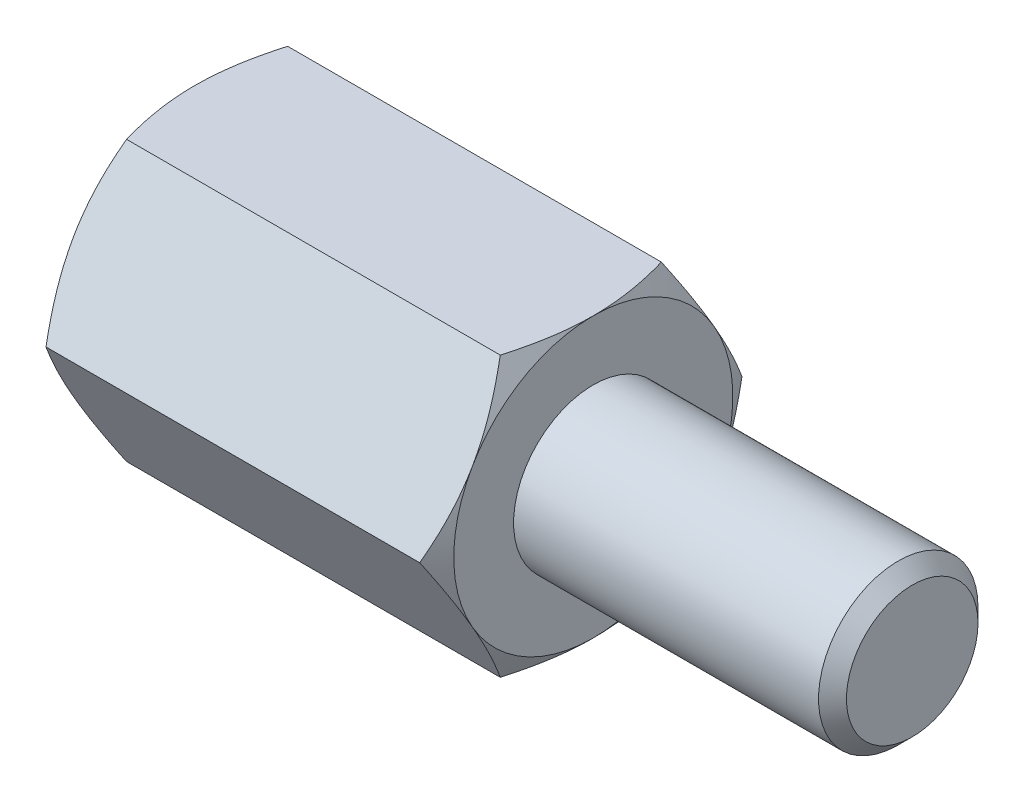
ISO-10303-21;
HEADER;
FILE_DESCRIPTION(('STEP AP214'),'2;1');
FILE_NAME('part.step','',(''),(''),'','','');
FILE_SCHEMA(('AUTOMOTIVE_DESIGN { 1 0 10303 214 1 1 1 1 }'));
ENDSEC;
DATA;
#1=APPLICATION_CONTEXT('core data for automotive mechanical design processes');
#2=APPLICATION_PROTOCOL_DEFINITION('international standard','automotive_design',2000,#1);
#3=PRODUCT_CONTEXT('',#1,'mechanical');
#4=PRODUCT('Part','Part','',(#3));
#5=PRODUCT_RELATED_PRODUCT_CATEGORY('part','',(#4));
#6=PRODUCT_DEFINITION_FORMATION('','',#4);
#7=PRODUCT_DEFINITION_CONTEXT('part definition',#1,'design');
#8=PRODUCT_DEFINITION('design','',#6,#7);
#9=PRODUCT_DEFINITION_SHAPE('','',#8);
#10=(LENGTH_UNIT() NAMED_UNIT(*) SI_UNIT(.MILLI.,.METRE.));
#11=(NAMED_UNIT(*) PLANE_ANGLE_UNIT() SI_UNIT($,.RADIAN.));
#12=(NAMED_UNIT(*) SI_UNIT($,.STERADIAN.) SOLID_ANGLE_UNIT());
#13=UNCERTAINTY_MEASURE_WITH_UNIT(LENGTH_MEASURE(1.E-05),#10,'distance_accuracy_value','');
#14=(GEOMETRIC_REPRESENTATION_CONTEXT(3) GLOBAL_UNCERTAINTY_ASSIGNED_CONTEXT((#13)) GLOBAL_UNIT_ASSIGNED_CONTEXT((#10,
#11,#12)) REPRESENTATION_CONTEXT('',''));
#15=CARTESIAN_POINT('',(0.,0.,0.));
#16=DIRECTION('',(0.,0.,1.));
#17=DIRECTION('',(1.,0.,0.));
#18=AXIS2_PLACEMENT_3D('',#15,#16,#17);
#19=CARTESIAN_POINT('',(5.,3.5,-2.02072594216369));
#20=DIRECTION('',(1.,0.,0.));
#21=DIRECTION('',(0.,0.,-1.));
#22=AXIS2_PLACEMENT_3D('',#19,#20,#21);
#23=PLANE('',#22);
#24=CARTESIAN_POINT('',(5.,0.,0.));
#25=DIRECTION('',(1.,0.,0.));
#26=DIRECTION('',(0.,0.,-1.));
#27=AXIS2_PLACEMENT_3D('',#24,#25,#26);
#28=CIRCLE('',#27,3.5);
#29=CARTESIAN_POINT('',(5.,-1.75,-3.03108891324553));
#30=VERTEX_POINT('',#29);
#31=CARTESIAN_POINT('',(5.,1.75,-3.03108891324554));
#32=VERTEX_POINT('',#31);
#33=EDGE_CURVE('E288',#30,#32,#28,.T.);
#34=ORIENTED_EDGE('',*,*,#33,.T.);
#35=CARTESIAN_POINT('',(5.,3.5,0.));
#36=VERTEX_POINT('',#35);
#37=EDGE_CURVE('E53',#32,#36,#28,.T.);
#38=ORIENTED_EDGE('',*,*,#37,.T.);
#39=CARTESIAN_POINT('',(5.,1.75,3.03108891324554));
#40=VERTEX_POINT('',#39);
#41=EDGE_CURVE('E297',#36,#40,#28,.T.);
#42=ORIENTED_EDGE('',*,*,#41,.T.);
#43=CARTESIAN_POINT('',(5.,-1.75,3.03108891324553));
#44=VERTEX_POINT('',#43);
#45=EDGE_CURVE('E303',#40,#44,#28,.T.);
#46=ORIENTED_EDGE('',*,*,#45,.T.);
#47=CARTESIAN_POINT('',(5.,0.,0.));
#48=DIRECTION('',(-1.,0.,0.));
#49=DIRECTION('',(0.,-1.,0.));
#50=AXIS2_PLACEMENT_3D('',#47,#48,#49);
#51=CIRCLE('',#50,3.5);
#52=CARTESIAN_POINT('',(5.,-3.5,0.));
#53=VERTEX_POINT('',#52);
#54=EDGE_CURVE('E193',#53,#44,#51,.T.);
#55=ORIENTED_EDGE('',*,*,#54,.F.);
#56=EDGE_CURVE('E61',#53,#30,#28,.T.);
#57=ORIENTED_EDGE('',*,*,#56,.T.);
#58=EDGE_LOOP('',(#34,#38,#42,#46,#55,#57));
#59=FACE_BOUND('',#58,.T.);
#60=CARTESIAN_POINT('',(5.,0.,0.));
#61=DIRECTION('',(1.,0.,0.));
#62=DIRECTION('',(0.,0.,-1.));
#63=AXIS2_PLACEMENT_3D('',#60,#61,#62);
#64=CIRCLE('',#63,2.);
#65=CARTESIAN_POINT('',(5.,0.,-2.));
#66=VERTEX_POINT('',#65);
#67=EDGE_CURVE('E433',#66,#66,#64,.T.);
#68=ORIENTED_EDGE('',*,*,#67,.F.);
#69=EDGE_LOOP('',(#68));
#70=FACE_BOUND('',#69,.T.);
#71=ADVANCED_FACE('F37',(#59,#70),#23,.T.);
#72=CARTESIAN_POINT('',(5.,0.,-4.04145188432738));
#73=DIRECTION('',(0.,-0.5,0.866025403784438));
#74=DIRECTION('',(0.,-0.866025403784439,-0.5));
#75=AXIS2_PLACEMENT_3D('',#72,#73,#74);
#76=PLANE('',#75);
#77=CARTESIAN_POINT('',(4.68732593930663,-0.000200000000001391,-4.04156735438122));
#78=CARTESIAN_POINT('',(4.73861421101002,0.153607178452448,-3.9527667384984));
#79=CARTESIAN_POINT('',(4.78525904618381,0.308742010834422,-3.86319960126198));
#80=CARTESIAN_POINT('',(4.86667812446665,0.621698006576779,-3.68251437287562));
#81=CARTESIAN_POINT('',(4.90142356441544,0.779524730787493,-3.59139307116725));
#82=CARTESIAN_POINT('',(4.95550997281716,1.09322221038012,-3.41027974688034));
#83=CARTESIAN_POINT('',(4.97521091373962,1.24904469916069,-3.32031559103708));
#84=CARTESIAN_POINT('',(4.99872986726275,1.56142288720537,-3.13996396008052));
#85=CARTESIAN_POINT('',(5.00256735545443,1.71797745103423,-3.04957714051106));
#86=CARTESIAN_POINT('',(4.99458469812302,2.01050921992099,-2.88068384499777));
#87=CARTESIAN_POINT('',(4.98472456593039,2.1465302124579,-2.80215208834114));
#88=CARTESIAN_POINT('',(4.9534735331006,2.41768602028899,-2.64560020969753));
#89=CARTESIAN_POINT('',(4.9320719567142,2.55281989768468,-2.5675806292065));
#90=CARTESIAN_POINT('',(4.87856959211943,2.82453479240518,-2.41070596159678));
#91=CARTESIAN_POINT('',(4.84624200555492,2.96108141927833,-2.33187072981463));
#92=CARTESIAN_POINT('',(4.77287106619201,3.2321380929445,-2.17537608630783));
#93=CARTESIAN_POINT('',(4.73184495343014,3.36665161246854,-2.09771466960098));
#94=CARTESIAN_POINT('',(4.68732593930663,3.5002,-2.02061047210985));
#95=B_SPLINE_CURVE_WITH_KNOTS('',3,(#77,#78,#79,#80,#81,#82,#83,#84,#85,#86,#87,#88,#89,#90,#91,
#92,#93,#94),.UNSPECIFIED.,.F.,.F.,(4,2,2,2,2,2,2,2,4),(0.,0.554793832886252,1.11092123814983,
1.65328467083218,2.19498204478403,2.6666513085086,3.13875761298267,3.6213361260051,
4.10296698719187),.UNSPECIFIED.);
#96=CARTESIAN_POINT('',(4.68739260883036,0.,-4.04145188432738));
#97=VERTEX_POINT('',#96);
#98=EDGE_CURVE('E317',#97,#32,#95,.T.);
#99=ORIENTED_EDGE('',*,*,#98,.F.);
#100=DIRECTION('',(-1.,0.,0.));
#101=VECTOR('',#100,1.);
#102=CARTESIAN_POINT('',(5.,0.,-4.04145188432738));
#103=LINE('',#102,#101);
#104=CARTESIAN_POINT('',(-4.68739260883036,0.,-4.04145188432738));
#105=VERTEX_POINT('',#104);
#106=EDGE_CURVE('E264',#97,#105,#103,.T.);
#107=ORIENTED_EDGE('',*,*,#106,.T.);
#108=CARTESIAN_POINT('',(-4.68732593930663,3.5002,-2.02061047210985));
#109=CARTESIAN_POINT('',(-4.73861421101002,3.34639282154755,-2.10941108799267));
#110=CARTESIAN_POINT('',(-4.78525904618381,3.19125798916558,-2.19897822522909));
#111=CARTESIAN_POINT('',(-4.86667812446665,2.87830199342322,-2.37966345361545));
#112=CARTESIAN_POINT('',(-4.90142356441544,2.7204752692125,-2.47078475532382));
#113=CARTESIAN_POINT('',(-4.95550997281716,2.40677778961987,-2.65189807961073));
#114=CARTESIAN_POINT('',(-4.97521091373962,2.25095530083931,-2.74186223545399));
#115=CARTESIAN_POINT('',(-4.99872986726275,1.93857711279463,-2.92221386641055));
#116=CARTESIAN_POINT('',(-5.00256735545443,1.78202254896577,-3.01260068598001));
#117=CARTESIAN_POINT('',(-4.99458469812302,1.48949078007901,-3.1814939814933));
#118=CARTESIAN_POINT('',(-4.98472456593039,1.3534697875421,-3.26002573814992));
#119=CARTESIAN_POINT('',(-4.9534735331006,1.08231397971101,-3.41657761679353));
#120=CARTESIAN_POINT('',(-4.9320719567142,0.947180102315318,-3.49459719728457));
#121=CARTESIAN_POINT('',(-4.87856959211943,0.675465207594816,-3.65147186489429));
#122=CARTESIAN_POINT('',(-4.84624200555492,0.538918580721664,-3.73030709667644));
#123=CARTESIAN_POINT('',(-4.77287106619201,0.267861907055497,-3.88680174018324));
#124=CARTESIAN_POINT('',(-4.73184495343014,0.133348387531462,-3.96446315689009));
#125=CARTESIAN_POINT('',(-4.68732593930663,-0.000200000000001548,-4.04156735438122));
#126=B_SPLINE_CURVE_WITH_KNOTS('',3,(#108,#109,#110,#111,#112,#113,#114,#115,#116,#117,#118,
#119,#120,#121,#122,#123,#124,#125),.UNSPECIFIED.,.F.,.F.,(4,2,2,2,2,2,2,2,4),(0.,
0.554793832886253,1.11092123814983,1.65328467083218,2.19498204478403,2.6666513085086,
3.13875761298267,3.6213361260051,4.10296698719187),.UNSPECIFIED.);
#127=CARTESIAN_POINT('',(-5.,1.75,-3.03108891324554));
#128=VERTEX_POINT('',#127);
#129=EDGE_CURVE('E422',#128,#105,#126,.T.);
#130=ORIENTED_EDGE('',*,*,#129,.F.);
#131=CARTESIAN_POINT('',(-4.68739260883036,3.5,-2.02072594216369));
#132=VERTEX_POINT('',#131);
#133=EDGE_CURVE('E366',#132,#128,#126,.T.);
#134=ORIENTED_EDGE('',*,*,#133,.F.);
#135=DIRECTION('',(-1.,0.,0.));
#136=VECTOR('',#135,1.);
#137=CARTESIAN_POINT('',(5.,3.5,-2.02072594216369));
#138=LINE('',#137,#136);
#139=CARTESIAN_POINT('',(4.68739260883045,3.5,-2.02072594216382));
#140=VERTEX_POINT('',#139);
#141=EDGE_CURVE('E279',#140,#132,#138,.T.);
#142=ORIENTED_EDGE('',*,*,#141,.F.);
#143=EDGE_CURVE('E229',#32,#140,#95,.T.);
#144=ORIENTED_EDGE('',*,*,#143,.F.);
#145=EDGE_LOOP('',(#99,#107,#130,#134,#142,#144));
#146=FACE_BOUND('',#145,.T.);
#147=ADVANCED_FACE('F148',(#146),#76,.F.);
#148=CARTESIAN_POINT('',(5.,3.5,-2.02072594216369));
#149=DIRECTION('',(0.,-1.,0.));
#150=DIRECTION('',(0.,0.,-1.));
#151=AXIS2_PLACEMENT_3D('',#148,#149,#150);
#152=PLANE('',#151);
#153=CARTESIAN_POINT('',(3.24432944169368,3.5,-5.52571367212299));
#154=CARTESIAN_POINT('',(3.3192813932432,3.5,-5.37200190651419));
#155=CARTESIAN_POINT('',(3.39354243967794,3.5,-5.21794762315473));
#156=CARTESIAN_POINT('',(3.54029601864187,3.5,-4.90897223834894));
#157=CARTESIAN_POINT('',(3.61278829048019,3.5,-4.75405101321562));
#158=CARTESIAN_POINT('',(3.75596172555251,3.5,-4.44240758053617));
#159=CARTESIAN_POINT('',(3.82663168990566,3.5,-4.28568021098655));
#160=CARTESIAN_POINT('',(3.96520746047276,3.5,-3.97101270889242));
#161=CARTESIAN_POINT('',(4.03311339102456,3.5,-3.81307263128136));
#162=CARTESIAN_POINT('',(4.16771439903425,3.5,-3.49026114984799));
#163=CARTESIAN_POINT('',(4.23428710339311,3.5,-3.32533845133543));
#164=CARTESIAN_POINT('',(4.36262677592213,3.5,-2.99359992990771));
#165=CARTESIAN_POINT('',(4.42439321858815,3.5,-2.82678390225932));
#166=CARTESIAN_POINT('',(4.54157006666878,3.5,-2.49127529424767));
#167=CARTESIAN_POINT('',(4.59699254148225,3.5,-2.32258697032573));
#168=CARTESIAN_POINT('',(4.69976794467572,3.5,-1.98279215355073));
#169=CARTESIAN_POINT('',(4.74712331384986,3.5,-1.81168640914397));
#170=CARTESIAN_POINT('',(4.83129873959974,3.5,-1.46793354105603));
#171=CARTESIAN_POINT('',(4.86817965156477,3.5,-1.2953015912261));
#172=CARTESIAN_POINT('',(4.92939557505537,3.5,-0.947791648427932));
#173=CARTESIAN_POINT('',(4.95373192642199,3.5,-0.772913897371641));
#174=CARTESIAN_POINT('',(4.9876038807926,3.5,-0.424108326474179));
#175=CARTESIAN_POINT('',(4.99733725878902,3.5,-0.250200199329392));
#176=CARTESIAN_POINT('',(5.00170533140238,3.5,0.0978233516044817));
#177=CARTESIAN_POINT('',(4.99633996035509,3.5,0.27193877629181));
#178=CARTESIAN_POINT('',(4.97501181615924,3.5,0.564711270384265));
#179=CARTESIAN_POINT('',(4.96289198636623,3.5,0.683667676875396));
#180=CARTESIAN_POINT('',(4.93230809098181,3.5,0.920767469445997));
#181=CARTESIAN_POINT('',(4.91384324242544,3.5,1.03891075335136));
#182=CARTESIAN_POINT('',(4.84989562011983,3.5,1.39193174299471));
#183=CARTESIAN_POINT('',(4.79586958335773,3.5,1.62528232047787));
#184=CARTESIAN_POINT('',(4.70145152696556,3.5,1.97433825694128));
#185=CARTESIAN_POINT('',(4.66729009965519,3.5,2.09183268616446));
#186=CARTESIAN_POINT('',(4.59523444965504,3.5,2.32568238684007));
#187=CARTESIAN_POINT('',(4.55734019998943,3.5,2.44203765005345));
#188=CARTESIAN_POINT('',(4.47844216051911,3.5,2.67364238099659));
#189=CARTESIAN_POINT('',(4.43743925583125,3.5,2.78889215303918));
#190=CARTESIAN_POINT('',(4.35282457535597,3.5,3.01842460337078));
#191=CARTESIAN_POINT('',(4.3092128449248,3.5,3.13270729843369));
#192=CARTESIAN_POINT('',(4.19582414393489,3.5,3.42150510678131));
#193=CARTESIAN_POINT('',(4.12456360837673,3.5,3.59543696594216));
#194=CARTESIAN_POINT('',(3.97810267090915,3.5,3.94163961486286));
#195=CARTESIAN_POINT('',(3.90290192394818,3.5,4.11391025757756));
#196=CARTESIAN_POINT('',(3.74942525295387,3.5,4.45713072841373));
#197=CARTESIAN_POINT('',(3.67114846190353,3.5,4.62808016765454));
#198=CARTESIAN_POINT('',(3.51218826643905,3.5,4.96885843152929));
#199=CARTESIAN_POINT('',(3.43150479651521,3.5,5.13868722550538));
#200=CARTESIAN_POINT('',(3.18638713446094,3.5,5.64726192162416));
#201=CARTESIAN_POINT('',(3.0190975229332,3.5,5.98463020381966));
#202=CARTESIAN_POINT('',(2.67958549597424,3.5,6.65678495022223));
#203=CARTESIAN_POINT('',(2.5073639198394,3.5,6.99157184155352));
#204=CARTESIAN_POINT('',(2.17608002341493,3.5,7.62749570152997));
#205=CARTESIAN_POINT('',(2.01732992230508,3.5,7.92879562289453));
#206=CARTESIAN_POINT('',(1.69774734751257,3.5,8.53030635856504));
#207=CARTESIAN_POINT('',(1.53691477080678,3.5,8.83051711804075));
#208=CARTESIAN_POINT('',(1.21417926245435,3.5,9.42918006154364));
#209=CARTESIAN_POINT('',(1.0522810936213,3.5,9.72763481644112));
#210=CARTESIAN_POINT('',(0.727273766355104,3.5,10.3238577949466));
#211=CARTESIAN_POINT('',(0.56416469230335,3.5,10.6216260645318));
#212=CARTESIAN_POINT('',(0.400610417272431,3.5,10.9191478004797));
#213=B_SPLINE_CURVE_WITH_KNOTS('',3,(#153,#154,#155,#156,#157,#158,#159,#160,#161,#162,#163,
#164,#165,#166,#167,#168,#169,#170,#171,#172,#173,#174,#175,#176,#177,#178,#179,#180,#181,#182,
#183,#184,#185,#186,#187,#188,#189,#190,#191,#192,#193,#194,#195,#196,#197,#198,#199,#200,#201,
#202,#203,#204,#205,#206,#207,#208,#209,#210,#211,#212),.UNSPECIFIED.,.F.,.F.,(4,2,2,2,2,2,2,2,
2,2,2,2,2,2,2,2,2,2,2,2,2,2,2,2,2,2,2,2,2,4),(0.,0.513041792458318,1.02615874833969,
1.54190801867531,2.05763406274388,2.59113284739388,3.1246898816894,3.65721433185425,
4.18957737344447,4.71878103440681,5.247928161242,5.76984197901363,6.29175806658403,
6.65030258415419,7.0088913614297,7.72642330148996,8.09346920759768,8.46051776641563,
8.8274622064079,9.19440026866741,9.75822236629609,10.3220939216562,10.8861255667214,
11.4501725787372,12.579801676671,13.7092396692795,14.730918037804,15.7526471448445,
16.7712589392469,17.7898004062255),.UNSPECIFIED.);
#214=EDGE_CURVE('E227',#140,#36,#213,.T.);
#215=ORIENTED_EDGE('',*,*,#214,.F.);
#216=ORIENTED_EDGE('',*,*,#141,.T.);
#217=CARTESIAN_POINT('',(-3.24432944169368,3.5,-5.52571367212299));
#218=CARTESIAN_POINT('',(-3.3192813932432,3.5,-5.37200190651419));
#219=CARTESIAN_POINT('',(-3.39354243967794,3.5,-5.21794762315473));
#220=CARTESIAN_POINT('',(-3.54029601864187,3.5,-4.90897223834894));
#221=CARTESIAN_POINT('',(-3.61278829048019,3.5,-4.75405101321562));
#222=CARTESIAN_POINT('',(-3.75596172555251,3.5,-4.44240758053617));
#223=CARTESIAN_POINT('',(-3.82663168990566,3.5,-4.28568021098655));
#224=CARTESIAN_POINT('',(-3.96520746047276,3.5,-3.97101270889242));
#225=CARTESIAN_POINT('',(-4.03311339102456,3.5,-3.81307263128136));
#226=CARTESIAN_POINT('',(-4.16771439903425,3.5,-3.49026114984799));
#227=CARTESIAN_POINT('',(-4.23428710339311,3.5,-3.32533845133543));
#228=CARTESIAN_POINT('',(-4.36262677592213,3.5,-2.99359992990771));
#229=CARTESIAN_POINT('',(-4.42439321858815,3.5,-2.82678390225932));
#230=CARTESIAN_POINT('',(-4.54157006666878,3.5,-2.49127529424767));
#231=CARTESIAN_POINT('',(-4.59699254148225,3.5,-2.32258697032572));
#232=CARTESIAN_POINT('',(-4.69976794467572,3.5,-1.98279215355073));
#233=CARTESIAN_POINT('',(-4.74712331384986,3.5,-1.81168640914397));
#234=CARTESIAN_POINT('',(-4.83129873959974,3.5,-1.46793354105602));
#235=CARTESIAN_POINT('',(-4.86817965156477,3.5,-1.2953015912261));
#236=CARTESIAN_POINT('',(-4.92939557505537,3.5,-0.947791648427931));
#237=CARTESIAN_POINT('',(-4.95373192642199,3.5,-0.77291389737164));
#238=CARTESIAN_POINT('',(-4.9876038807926,3.5,-0.424108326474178));
#239=CARTESIAN_POINT('',(-4.99733725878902,3.5,-0.250200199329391));
#240=CARTESIAN_POINT('',(-5.00170533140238,3.5,0.0978233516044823));
#241=CARTESIAN_POINT('',(-4.99633996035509,3.5,0.27193877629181));
#242=CARTESIAN_POINT('',(-4.97501181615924,3.5,0.564711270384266));
#243=CARTESIAN_POINT('',(-4.96289198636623,3.5,0.683667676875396));
#244=CARTESIAN_POINT('',(-4.93230809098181,3.5,0.920767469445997));
#245=CARTESIAN_POINT('',(-4.91384324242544,3.5,1.03891075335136));
#246=CARTESIAN_POINT('',(-4.84989562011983,3.5,1.39193174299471));
#247=CARTESIAN_POINT('',(-4.79586958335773,3.5,1.62528232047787));
#248=CARTESIAN_POINT('',(-4.70145152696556,3.5,1.97433825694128));
#249=CARTESIAN_POINT('',(-4.66729009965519,3.5,2.09183268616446));
#250=CARTESIAN_POINT('',(-4.59523444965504,3.5,2.32568238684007));
#251=CARTESIAN_POINT('',(-4.55734019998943,3.5,2.44203765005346));
#252=CARTESIAN_POINT('',(-4.47844216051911,3.5,2.67364238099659));
#253=CARTESIAN_POINT('',(-4.43743925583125,3.5,2.78889215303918));
#254=CARTESIAN_POINT('',(-4.35282457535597,3.5,3.01842460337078));
#255=CARTESIAN_POINT('',(-4.30921284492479,3.5,3.13270729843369));
#256=CARTESIAN_POINT('',(-4.19582414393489,3.5,3.42150510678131));
#257=CARTESIAN_POINT('',(-4.12456360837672,3.5,3.59543696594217));
#258=CARTESIAN_POINT('',(-3.97810267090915,3.5,3.94163961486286));
#259=CARTESIAN_POINT('',(-3.90290192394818,3.5,4.11391025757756));
#260=CARTESIAN_POINT('',(-3.74942525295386,3.5,4.45713072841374));
#261=CARTESIAN_POINT('',(-3.67114846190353,3.5,4.62808016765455));
#262=CARTESIAN_POINT('',(-3.51218826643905,3.5,4.9688584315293));
#263=CARTESIAN_POINT('',(-3.43150479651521,3.5,5.13868722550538));
#264=CARTESIAN_POINT('',(-3.18638713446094,3.5,5.64726192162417));
#265=CARTESIAN_POINT('',(-3.0190975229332,3.5,5.98463020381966));
#266=CARTESIAN_POINT('',(-2.67958549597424,3.5,6.65678495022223));
#267=CARTESIAN_POINT('',(-2.5073639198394,3.5,6.99157184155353));
#268=CARTESIAN_POINT('',(-2.17608002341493,3.5,7.62749570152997));
#269=CARTESIAN_POINT('',(-2.01732992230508,3.5,7.92879562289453));
#270=CARTESIAN_POINT('',(-1.69774734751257,3.5,8.53030635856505));
#271=CARTESIAN_POINT('',(-1.53691477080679,3.5,8.83051711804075));
#272=CARTESIAN_POINT('',(-1.21417926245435,3.5,9.42918006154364));
#273=CARTESIAN_POINT('',(-1.0522810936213,3.5,9.72763481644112));
#274=CARTESIAN_POINT('',(-0.727273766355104,3.5,10.3238577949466));
#275=CARTESIAN_POINT('',(-0.564164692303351,3.5,10.6216260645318));
#276=CARTESIAN_POINT('',(-0.400610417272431,3.5,10.9191478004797));
#277=B_SPLINE_CURVE_WITH_KNOTS('',3,(#217,#218,#219,#220,#221,#222,#223,#224,#225,#226,#227,
#228,#229,#230,#231,#232,#233,#234,#235,#236,#237,#238,#239,#240,#241,#242,#243,#244,#245,#246,
#247,#248,#249,#250,#251,#252,#253,#254,#255,#256,#257,#258,#259,#260,#261,#262,#263,#264,#265,
#266,#267,#268,#269,#270,#271,#272,#273,#274,#275,#276),.UNSPECIFIED.,.F.,.F.,(4,2,2,2,2,2,2,2,
2,2,2,2,2,2,2,2,2,2,2,2,2,2,2,2,2,2,2,2,2,4),(0.,0.513041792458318,1.02615874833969,
1.54190801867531,2.05763406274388,2.59113284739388,3.1246898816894,3.65721433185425,
4.18957737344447,4.71878103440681,5.24792816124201,5.76984197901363,6.29175806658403,
6.65030258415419,7.0088913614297,7.72642330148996,8.09346920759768,8.46051776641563,
8.8274622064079,9.19440026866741,9.75822236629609,10.3220939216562,10.8861255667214,
11.4501725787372,12.579801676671,13.7092396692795,14.730918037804,15.7526471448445,
16.7712589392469,17.7898004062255),.UNSPECIFIED.);
#278=CARTESIAN_POINT('',(-5.,3.5,0.));
#279=VERTEX_POINT('',#278);
#280=EDGE_CURVE('E241',#279,#132,#277,.F.);
#281=ORIENTED_EDGE('',*,*,#280,.F.);
#282=CARTESIAN_POINT('',(-4.68739260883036,3.5,2.02072594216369));
#283=VERTEX_POINT('',#282);
#284=EDGE_CURVE('E249',#283,#279,#277,.F.);
#285=ORIENTED_EDGE('',*,*,#284,.F.);
#286=DIRECTION('',(-1.,0.,0.));
#287=VECTOR('',#286,1.);
#288=CARTESIAN_POINT('',(5.,3.5,2.02072594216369));
#289=LINE('',#288,#287);
#290=CARTESIAN_POINT('',(4.68739260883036,3.5,2.02072594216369));
#291=VERTEX_POINT('',#290);
#292=EDGE_CURVE('E276',#291,#283,#289,.T.);
#293=ORIENTED_EDGE('',*,*,#292,.F.);
#294=EDGE_CURVE('E221',#36,#291,#213,.T.);
#295=ORIENTED_EDGE('',*,*,#294,.F.);
#296=EDGE_LOOP('',(#215,#216,#281,#285,#293,#295));
#297=FACE_BOUND('',#296,.T.);
#298=ADVANCED_FACE('F153',(#297),#152,.F.);
#299=CARTESIAN_POINT('',(5.,3.5,2.02072594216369));
#300=DIRECTION('',(0.,-0.5,-0.866025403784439));
#301=DIRECTION('',(0.,0.866025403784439,-0.5));
#302=AXIS2_PLACEMENT_3D('',#299,#300,#301);
#303=PLANE('',#302);
#304=CARTESIAN_POINT('',(4.68732593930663,3.5002,2.02061047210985));
#305=CARTESIAN_POINT('',(4.73861421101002,3.34639282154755,2.10941108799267));
#306=CARTESIAN_POINT('',(4.78525904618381,3.19125798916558,2.19897822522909));
#307=CARTESIAN_POINT('',(4.86667812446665,2.87830199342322,2.37966345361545));
#308=CARTESIAN_POINT('',(4.90142356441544,2.7204752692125,2.47078475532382));
#309=CARTESIAN_POINT('',(4.95550997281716,2.40677778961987,2.65189807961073));
#310=CARTESIAN_POINT('',(4.97521091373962,2.25095530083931,2.74186223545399));
#311=CARTESIAN_POINT('',(4.99872986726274,1.93857711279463,2.92221386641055));
#312=CARTESIAN_POINT('',(5.00256735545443,1.78202254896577,3.01260068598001));
#313=CARTESIAN_POINT('',(4.99458469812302,1.48949078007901,3.1814939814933));
#314=CARTESIAN_POINT('',(4.98472456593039,1.35346978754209,3.26002573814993));
#315=CARTESIAN_POINT('',(4.9534735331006,1.08231397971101,3.41657761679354));
#316=CARTESIAN_POINT('',(4.9320719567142,0.947180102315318,3.49459719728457));
#317=CARTESIAN_POINT('',(4.87856959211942,0.675465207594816,3.65147186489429));
#318=CARTESIAN_POINT('',(4.84624200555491,0.538918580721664,3.73030709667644));
#319=CARTESIAN_POINT('',(4.77287106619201,0.267861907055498,3.88680174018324));
#320=CARTESIAN_POINT('',(4.73184495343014,0.133348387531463,3.96446315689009));
#321=CARTESIAN_POINT('',(4.68732593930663,-0.000200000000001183,4.04156735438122));
#322=B_SPLINE_CURVE_WITH_KNOTS('',3,(#304,#305,#306,#307,#308,#309,#310,#311,#312,#313,#314,
#315,#316,#317,#318,#319,#320,#321),.UNSPECIFIED.,.F.,.F.,(4,2,2,2,2,2,2,2,4),(0.,
0.554793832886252,1.11092123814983,1.65328467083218,2.19498204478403,2.6666513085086,
3.13875761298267,3.62133612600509,4.10296698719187),.UNSPECIFIED.);
#323=EDGE_CURVE('E228',#291,#40,#322,.T.);
#324=ORIENTED_EDGE('',*,*,#323,.F.);
#325=ORIENTED_EDGE('',*,*,#292,.T.);
#326=CARTESIAN_POINT('',(-4.68732593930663,-0.000200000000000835,4.04156735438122));
#327=CARTESIAN_POINT('',(-4.73861421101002,0.153607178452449,3.9527667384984));
#328=CARTESIAN_POINT('',(-4.78525904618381,0.308742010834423,3.86319960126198));
#329=CARTESIAN_POINT('',(-4.86667812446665,0.621698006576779,3.68251437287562));
#330=CARTESIAN_POINT('',(-4.90142356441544,0.779524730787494,3.59139307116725));
#331=CARTESIAN_POINT('',(-4.95550997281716,1.09322221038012,3.41027974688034));
#332=CARTESIAN_POINT('',(-4.97521091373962,1.24904469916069,3.32031559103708));
#333=CARTESIAN_POINT('',(-4.99872986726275,1.56142288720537,3.13996396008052));
#334=CARTESIAN_POINT('',(-5.00256735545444,1.71797745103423,3.04957714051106));
#335=CARTESIAN_POINT('',(-4.99458469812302,2.01050921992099,2.88068384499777));
#336=CARTESIAN_POINT('',(-4.98472456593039,2.1465302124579,2.80215208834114));
#337=CARTESIAN_POINT('',(-4.9534735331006,2.41768602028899,2.64560020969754));
#338=CARTESIAN_POINT('',(-4.9320719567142,2.55281989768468,2.5675806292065));
#339=CARTESIAN_POINT('',(-4.87856959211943,2.82453479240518,2.41070596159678));
#340=CARTESIAN_POINT('',(-4.84624200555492,2.96108141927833,2.33187072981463));
#341=CARTESIAN_POINT('',(-4.77287106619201,3.2321380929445,2.17537608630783));
#342=CARTESIAN_POINT('',(-4.73184495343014,3.36665161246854,2.09771466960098));
#343=CARTESIAN_POINT('',(-4.68732593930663,3.5002,2.02061047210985));
#344=B_SPLINE_CURVE_WITH_KNOTS('',3,(#326,#327,#328,#329,#330,#331,#332,#333,#334,#335,#336,
#337,#338,#339,#340,#341,#342,#343),.UNSPECIFIED.,.F.,.F.,(4,2,2,2,2,2,2,2,4),(0.,
0.554793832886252,1.11092123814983,1.65328467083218,2.19498204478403,2.6666513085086,
3.13875761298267,3.62133612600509,4.10296698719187),.UNSPECIFIED.);
#345=CARTESIAN_POINT('',(-5.,1.75,3.03108891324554));
#346=VERTEX_POINT('',#345);
#347=EDGE_CURVE('E255',#346,#283,#344,.T.);
#348=ORIENTED_EDGE('',*,*,#347,.F.);
#349=CARTESIAN_POINT('',(-4.68739260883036,0.,4.04145188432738));
#350=VERTEX_POINT('',#349);
#351=EDGE_CURVE('E262',#350,#346,#344,.T.);
#352=ORIENTED_EDGE('',*,*,#351,.F.);
#353=DIRECTION('',(-1.,0.,0.));
#354=VECTOR('',#353,1.);
#355=CARTESIAN_POINT('',(5.,0.,4.04145188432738));
#356=LINE('',#355,#354);
#357=CARTESIAN_POINT('',(4.68739260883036,0.,4.04145188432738));
#358=VERTEX_POINT('',#357);
#359=EDGE_CURVE('E273',#358,#350,#356,.T.);
#360=ORIENTED_EDGE('',*,*,#359,.F.);
#361=EDGE_CURVE('E215',#40,#358,#322,.T.);
#362=ORIENTED_EDGE('',*,*,#361,.F.);
#363=EDGE_LOOP('',(#324,#325,#348,#352,#360,#362));
#364=FACE_BOUND('',#363,.T.);
#365=ADVANCED_FACE('F235',(#364),#303,.F.);
#366=CARTESIAN_POINT('',(5.,0.,4.04145188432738));
#367=DIRECTION('',(0.,0.5,-0.866025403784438));
#368=DIRECTION('',(0.,0.866025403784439,0.5));
#369=AXIS2_PLACEMENT_3D('',#366,#367,#368);
#370=PLANE('',#369);
#371=CARTESIAN_POINT('',(4.68732593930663,0.000199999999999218,4.04156735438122));
#372=CARTESIAN_POINT('',(4.73861421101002,-0.15360717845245,3.9527667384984));
#373=CARTESIAN_POINT('',(4.7852590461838,-0.308742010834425,3.86319960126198));
#374=CARTESIAN_POINT('',(4.86667812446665,-0.621698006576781,3.68251437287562));
#375=CARTESIAN_POINT('',(4.90142356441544,-0.779524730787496,3.59139307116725));
#376=CARTESIAN_POINT('',(4.95550997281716,-1.09322221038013,3.41027974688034));
#377=CARTESIAN_POINT('',(4.97521091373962,-1.24904469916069,3.32031559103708));
#378=CARTESIAN_POINT('',(4.99872986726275,-1.56142288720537,3.13996396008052));
#379=CARTESIAN_POINT('',(5.00256735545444,-1.71797745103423,3.04957714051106));
#380=CARTESIAN_POINT('',(4.99458469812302,-2.01050921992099,2.88068384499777));
#381=CARTESIAN_POINT('',(4.98472456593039,-2.1465302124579,2.80215208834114));
#382=CARTESIAN_POINT('',(4.9534735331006,-2.41768602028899,2.64560020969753));
#383=CARTESIAN_POINT('',(4.9320719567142,-2.55281989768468,2.5675806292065));
#384=CARTESIAN_POINT('',(4.87856959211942,-2.82453479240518,2.41070596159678));
#385=CARTESIAN_POINT('',(4.84624200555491,-2.96108141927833,2.33187072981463));
#386=CARTESIAN_POINT('',(4.77287106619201,-3.2321380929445,2.17537608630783));
#387=CARTESIAN_POINT('',(4.73184495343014,-3.36665161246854,2.09771466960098));
#388=CARTESIAN_POINT('',(4.68732593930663,-3.5002,2.02061047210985));
#389=B_SPLINE_CURVE_WITH_KNOTS('',3,(#371,#372,#373,#374,#375,#376,#377,#378,#379,#380,#381,
#382,#383,#384,#385,#386,#387,#388),.UNSPECIFIED.,.F.,.F.,(4,2,2,2,2,2,2,2,4),(0.,
0.554793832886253,1.11092123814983,1.65328467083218,2.19498204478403,2.6666513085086,
3.13875761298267,3.62133612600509,4.10296698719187),.UNSPECIFIED.);
#390=EDGE_CURVE('E313',#358,#44,#389,.T.);
#391=ORIENTED_EDGE('',*,*,#390,.F.);
#392=ORIENTED_EDGE('',*,*,#359,.T.);
#393=CARTESIAN_POINT('',(-4.68732593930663,-3.5002,2.02061047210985));
#394=CARTESIAN_POINT('',(-4.73861421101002,-3.34639282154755,2.10941108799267));
#395=CARTESIAN_POINT('',(-4.7852590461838,-3.19125798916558,2.19897822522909));
#396=CARTESIAN_POINT('',(-4.86667812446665,-2.87830199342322,2.37966345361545));
#397=CARTESIAN_POINT('',(-4.90142356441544,-2.72047526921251,2.47078475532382));
#398=CARTESIAN_POINT('',(-4.95550997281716,-2.40677778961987,2.65189807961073));
#399=CARTESIAN_POINT('',(-4.97521091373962,-2.25095530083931,2.74186223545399));
#400=CARTESIAN_POINT('',(-4.99872986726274,-1.93857711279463,2.92221386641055));
#401=CARTESIAN_POINT('',(-5.00256735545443,-1.78202254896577,3.01260068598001));
#402=CARTESIAN_POINT('',(-4.99458469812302,-1.48949078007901,3.1814939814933));
#403=CARTESIAN_POINT('',(-4.98472456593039,-1.3534697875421,3.26002573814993));
#404=CARTESIAN_POINT('',(-4.9534735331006,-1.08231397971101,3.41657761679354));
#405=CARTESIAN_POINT('',(-4.9320719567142,-0.947180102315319,3.49459719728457));
#406=CARTESIAN_POINT('',(-4.87856959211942,-0.675465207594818,3.65147186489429));
#407=CARTESIAN_POINT('',(-4.84624200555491,-0.538918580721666,3.73030709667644));
#408=CARTESIAN_POINT('',(-4.77287106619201,-0.2678619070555,3.88680174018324));
#409=CARTESIAN_POINT('',(-4.73184495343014,-0.133348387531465,3.96446315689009));
#410=CARTESIAN_POINT('',(-4.68732593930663,0.000199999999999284,4.04156735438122));
#411=B_SPLINE_CURVE_WITH_KNOTS('',3,(#393,#394,#395,#396,#397,#398,#399,#400,#401,#402,#403,
#404,#405,#406,#407,#408,#409,#410),.UNSPECIFIED.,.F.,.F.,(4,2,2,2,2,2,2,2,4),(0.,
0.554793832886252,1.11092123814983,1.65328467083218,2.19498204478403,2.6666513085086,
3.13875761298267,3.62133612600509,4.10296698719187),.UNSPECIFIED.);
#412=CARTESIAN_POINT('',(-5.,-1.75,3.03108891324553));
#413=VERTEX_POINT('',#412);
#414=EDGE_CURVE('E263',#413,#350,#411,.T.);
#415=ORIENTED_EDGE('',*,*,#414,.F.);
#416=CARTESIAN_POINT('',(-4.68739260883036,-3.5,2.02072594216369));
#417=VERTEX_POINT('',#416);
#418=EDGE_CURVE('E250',#417,#413,#411,.T.);
#419=ORIENTED_EDGE('',*,*,#418,.F.);
#420=DIRECTION('',(-1.,0.,0.));
#421=VECTOR('',#420,1.);
#422=CARTESIAN_POINT('',(5.,-3.5,2.02072594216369));
#423=LINE('',#422,#421);
#424=CARTESIAN_POINT('',(4.68739260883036,-3.5,2.02072594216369));
#425=VERTEX_POINT('',#424);
#426=EDGE_CURVE('E270',#425,#417,#423,.T.);
#427=ORIENTED_EDGE('',*,*,#426,.F.);
#428=EDGE_CURVE('E210',#44,#425,#389,.T.);
#429=ORIENTED_EDGE('',*,*,#428,.F.);
#430=EDGE_LOOP('',(#391,#392,#415,#419,#427,#429));
#431=FACE_BOUND('',#430,.T.);
#432=ADVANCED_FACE('F403',(#431),#370,.F.);
#433=CARTESIAN_POINT('',(5.,-3.5,2.02072594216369));
#434=DIRECTION('',(0.,1.,0.));
#435=DIRECTION('',(0.,0.,1.));
#436=AXIS2_PLACEMENT_3D('',#433,#434,#435);
#437=PLANE('',#436);
#438=CARTESIAN_POINT('',(3.24432944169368,-3.5,-5.525713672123));
#439=CARTESIAN_POINT('',(3.3192813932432,-3.5,-5.37200190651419));
#440=CARTESIAN_POINT('',(3.39354243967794,-3.5,-5.21794762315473));
#441=CARTESIAN_POINT('',(3.54029601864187,-3.5,-4.90897223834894));
#442=CARTESIAN_POINT('',(3.61278829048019,-3.5,-4.75405101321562));
#443=CARTESIAN_POINT('',(3.75596172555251,-3.5,-4.44240758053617));
#444=CARTESIAN_POINT('',(3.82663168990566,-3.5,-4.28568021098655));
#445=CARTESIAN_POINT('',(3.96520746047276,-3.5,-3.97101270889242));
#446=CARTESIAN_POINT('',(4.03311339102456,-3.5,-3.81307263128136));
#447=CARTESIAN_POINT('',(4.16771439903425,-3.5,-3.49026114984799));
#448=CARTESIAN_POINT('',(4.2342871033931,-3.5,-3.32533845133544));
#449=CARTESIAN_POINT('',(4.36262677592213,-3.5,-2.99359992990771));
#450=CARTESIAN_POINT('',(4.42439321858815,-3.5,-2.82678390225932));
#451=CARTESIAN_POINT('',(4.54157006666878,-3.5,-2.49127529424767));
#452=CARTESIAN_POINT('',(4.59699254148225,-3.5,-2.32258697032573));
#453=CARTESIAN_POINT('',(4.69976794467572,-3.5,-1.98279215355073));
#454=CARTESIAN_POINT('',(4.74712331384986,-3.5,-1.81168640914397));
#455=CARTESIAN_POINT('',(4.83129873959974,-3.5,-1.46793354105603));
#456=CARTESIAN_POINT('',(4.86817965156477,-3.5,-1.2953015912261));
#457=CARTESIAN_POINT('',(4.92939557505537,-3.5,-0.947791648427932));
#458=CARTESIAN_POINT('',(4.95373192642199,-3.5,-0.772913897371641));
#459=CARTESIAN_POINT('',(4.9876038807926,-3.5,-0.424108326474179));
#460=CARTESIAN_POINT('',(4.99733725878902,-3.5,-0.250200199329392));
#461=CARTESIAN_POINT('',(5.00170533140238,-3.5,0.0978233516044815));
#462=CARTESIAN_POINT('',(4.99633996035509,-3.5,0.271938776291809));
#463=CARTESIAN_POINT('',(4.97501181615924,-3.5,0.564711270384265));
#464=CARTESIAN_POINT('',(4.96289198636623,-3.5,0.683667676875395));
#465=CARTESIAN_POINT('',(4.93230809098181,-3.5,0.920767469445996));
#466=CARTESIAN_POINT('',(4.91384324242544,-3.5,1.03891075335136));
#467=CARTESIAN_POINT('',(4.84989562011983,-3.5,1.39193174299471));
#468=CARTESIAN_POINT('',(4.79586958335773,-3.5,1.62528232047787));
#469=CARTESIAN_POINT('',(4.70145152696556,-3.5,1.97433825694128));
#470=CARTESIAN_POINT('',(4.66729009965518,-3.5,2.09183268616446));
#471=CARTESIAN_POINT('',(4.59523444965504,-3.5,2.32568238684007));
#472=CARTESIAN_POINT('',(4.55734019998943,-3.5,2.44203765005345));
#473=CARTESIAN_POINT('',(4.47844216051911,-3.5,2.67364238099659));
#474=CARTESIAN_POINT('',(4.43743925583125,-3.5,2.78889215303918));
#475=CARTESIAN_POINT('',(4.35282457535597,-3.5,3.01842460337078));
#476=CARTESIAN_POINT('',(4.3092128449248,-3.5,3.13270729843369));
#477=CARTESIAN_POINT('',(4.19582414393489,-3.5,3.42150510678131));
#478=CARTESIAN_POINT('',(4.12456360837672,-3.5,3.59543696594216));
#479=CARTESIAN_POINT('',(3.97810267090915,-3.5,3.94163961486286));
#480=CARTESIAN_POINT('',(3.90290192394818,-3.5,4.11391025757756));
#481=CARTESIAN_POINT('',(3.74942525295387,-3.5,4.45713072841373));
#482=CARTESIAN_POINT('',(3.67114846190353,-3.5,4.62808016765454));
#483=CARTESIAN_POINT('',(3.51218826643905,-3.5,4.96885843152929));
#484=CARTESIAN_POINT('',(3.43150479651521,-3.5,5.13868722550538));
#485=CARTESIAN_POINT('',(3.18638713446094,-3.5,5.64726192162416));
#486=CARTESIAN_POINT('',(3.0190975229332,-3.5,5.98463020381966));
#487=CARTESIAN_POINT('',(2.67958549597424,-3.5,6.65678495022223));
#488=CARTESIAN_POINT('',(2.5073639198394,-3.5,6.99157184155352));
#489=CARTESIAN_POINT('',(2.17608002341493,-3.5,7.62749570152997));
#490=CARTESIAN_POINT('',(2.01732992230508,-3.5,7.92879562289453));
#491=CARTESIAN_POINT('',(1.69774734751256,-3.5,8.53030635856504));
#492=CARTESIAN_POINT('',(1.53691477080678,-3.5,8.83051711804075));
#493=CARTESIAN_POINT('',(1.21417926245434,-3.5,9.42918006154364));
#494=CARTESIAN_POINT('',(1.0522810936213,-3.5,9.72763481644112));
#495=CARTESIAN_POINT('',(0.727273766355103,-3.5,10.3238577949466));
#496=CARTESIAN_POINT('',(0.56416469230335,-3.5,10.6216260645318));
#497=CARTESIAN_POINT('',(0.400610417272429,-3.5,10.9191478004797));
#498=B_SPLINE_CURVE_WITH_KNOTS('',3,(#438,#439,#440,#441,#442,#443,#444,#445,#446,#447,#448,
#449,#450,#451,#452,#453,#454,#455,#456,#457,#458,#459,#460,#461,#462,#463,#464,#465,#466,#467,
#468,#469,#470,#471,#472,#473,#474,#475,#476,#477,#478,#479,#480,#481,#482,#483,#484,#485,#486,
#487,#488,#489,#490,#491,#492,#493,#494,#495,#496,#497),.UNSPECIFIED.,.F.,.F.,(4,2,2,2,2,2,2,2,
2,2,2,2,2,2,2,2,2,2,2,2,2,2,2,2,2,2,2,2,2,4),(0.,0.513041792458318,1.02615874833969,
1.54190801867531,2.05763406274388,2.59113284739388,3.1246898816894,3.65721433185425,
4.18957737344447,4.71878103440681,5.24792816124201,5.76984197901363,6.29175806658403,
6.65030258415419,7.0088913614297,7.72642330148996,8.09346920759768,8.46051776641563,
8.8274622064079,9.19440026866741,9.75822236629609,10.3220939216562,10.8861255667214,
11.4501725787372,12.579801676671,13.7092396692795,14.730918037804,15.7526471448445,
16.7712589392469,17.7898004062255),.UNSPECIFIED.);
#499=EDGE_CURVE('E344',#425,#53,#498,.F.);
#500=ORIENTED_EDGE('',*,*,#499,.F.);
#501=ORIENTED_EDGE('',*,*,#426,.T.);
#502=CARTESIAN_POINT('',(-3.24432944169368,-3.5,-5.525713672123));
#503=CARTESIAN_POINT('',(-3.3192813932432,-3.5,-5.37200190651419));
#504=CARTESIAN_POINT('',(-3.39354243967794,-3.5,-5.21794762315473));
#505=CARTESIAN_POINT('',(-3.54029601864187,-3.5,-4.90897223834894));
#506=CARTESIAN_POINT('',(-3.61278829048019,-3.5,-4.75405101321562));
#507=CARTESIAN_POINT('',(-3.75596172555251,-3.5,-4.44240758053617));
#508=CARTESIAN_POINT('',(-3.82663168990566,-3.5,-4.28568021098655));
#509=CARTESIAN_POINT('',(-3.96520746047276,-3.5,-3.97101270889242));
#510=CARTESIAN_POINT('',(-4.03311339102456,-3.5,-3.81307263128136));
#511=CARTESIAN_POINT('',(-4.16771439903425,-3.5,-3.49026114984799));
#512=CARTESIAN_POINT('',(-4.2342871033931,-3.5,-3.32533845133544));
#513=CARTESIAN_POINT('',(-4.36262677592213,-3.5,-2.99359992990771));
#514=CARTESIAN_POINT('',(-4.42439321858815,-3.5,-2.82678390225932));
#515=CARTESIAN_POINT('',(-4.54157006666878,-3.5,-2.49127529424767));
#516=CARTESIAN_POINT('',(-4.59699254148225,-3.5,-2.32258697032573));
#517=CARTESIAN_POINT('',(-4.69976794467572,-3.5,-1.98279215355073));
#518=CARTESIAN_POINT('',(-4.74712331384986,-3.5,-1.81168640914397));
#519=CARTESIAN_POINT('',(-4.83129873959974,-3.5,-1.46793354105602));
#520=CARTESIAN_POINT('',(-4.86817965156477,-3.5,-1.2953015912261));
#521=CARTESIAN_POINT('',(-4.92939557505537,-3.5,-0.947791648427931));
#522=CARTESIAN_POINT('',(-4.95373192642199,-3.5,-0.77291389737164));
#523=CARTESIAN_POINT('',(-4.9876038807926,-3.5,-0.424108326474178));
#524=CARTESIAN_POINT('',(-4.99733725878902,-3.5,-0.250200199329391));
#525=CARTESIAN_POINT('',(-5.00170533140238,-3.5,0.0978233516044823));
#526=CARTESIAN_POINT('',(-4.99633996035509,-3.5,0.27193877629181));
#527=CARTESIAN_POINT('',(-4.97501181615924,-3.5,0.564711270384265));
#528=CARTESIAN_POINT('',(-4.96289198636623,-3.5,0.683667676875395));
#529=CARTESIAN_POINT('',(-4.93230809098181,-3.5,0.920767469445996));
#530=CARTESIAN_POINT('',(-4.91384324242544,-3.5,1.03891075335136));
#531=CARTESIAN_POINT('',(-4.84989562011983,-3.5,1.39193174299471));
#532=CARTESIAN_POINT('',(-4.79586958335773,-3.5,1.62528232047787));
#533=CARTESIAN_POINT('',(-4.70145152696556,-3.5,1.97433825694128));
#534=CARTESIAN_POINT('',(-4.66729009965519,-3.5,2.09183268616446));
#535=CARTESIAN_POINT('',(-4.59523444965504,-3.5,2.32568238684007));
#536=CARTESIAN_POINT('',(-4.55734019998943,-3.5,2.44203765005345));
#537=CARTESIAN_POINT('',(-4.47844216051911,-3.5,2.67364238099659));
#538=CARTESIAN_POINT('',(-4.43743925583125,-3.5,2.78889215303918));
#539=CARTESIAN_POINT('',(-4.35282457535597,-3.5,3.01842460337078));
#540=CARTESIAN_POINT('',(-4.30921284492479,-3.5,3.13270729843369));
#541=CARTESIAN_POINT('',(-4.19582414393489,-3.5,3.42150510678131));
#542=CARTESIAN_POINT('',(-4.12456360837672,-3.5,3.59543696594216));
#543=CARTESIAN_POINT('',(-3.97810267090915,-3.5,3.94163961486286));
#544=CARTESIAN_POINT('',(-3.90290192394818,-3.5,4.11391025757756));
#545=CARTESIAN_POINT('',(-3.74942525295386,-3.5,4.45713072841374));
#546=CARTESIAN_POINT('',(-3.67114846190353,-3.5,4.62808016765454));
#547=CARTESIAN_POINT('',(-3.51218826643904,-3.5,4.96885843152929));
#548=CARTESIAN_POINT('',(-3.43150479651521,-3.5,5.13868722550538));
#549=CARTESIAN_POINT('',(-3.18638713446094,-3.5,5.64726192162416));
#550=CARTESIAN_POINT('',(-3.0190975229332,-3.5,5.98463020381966));
#551=CARTESIAN_POINT('',(-2.67958549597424,-3.5,6.65678495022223));
#552=CARTESIAN_POINT('',(-2.5073639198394,-3.5,6.99157184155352));
#553=CARTESIAN_POINT('',(-2.17608002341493,-3.5,7.62749570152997));
#554=CARTESIAN_POINT('',(-2.01732992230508,-3.5,7.92879562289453));
#555=CARTESIAN_POINT('',(-1.69774734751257,-3.5,8.53030635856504));
#556=CARTESIAN_POINT('',(-1.53691477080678,-3.5,8.83051711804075));
#557=CARTESIAN_POINT('',(-1.21417926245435,-3.5,9.42918006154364));
#558=CARTESIAN_POINT('',(-1.0522810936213,-3.5,9.72763481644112));
#559=CARTESIAN_POINT('',(-0.727273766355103,-3.5,10.3238577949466));
#560=CARTESIAN_POINT('',(-0.564164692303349,-3.5,10.6216260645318));
#561=CARTESIAN_POINT('',(-0.40061041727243,-3.5,10.9191478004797));
#562=B_SPLINE_CURVE_WITH_KNOTS('',3,(#502,#503,#504,#505,#506,#507,#508,#509,#510,#511,#512,
#513,#514,#515,#516,#517,#518,#519,#520,#521,#522,#523,#524,#525,#526,#527,#528,#529,#530,#531,
#532,#533,#534,#535,#536,#537,#538,#539,#540,#541,#542,#543,#544,#545,#546,#547,#548,#549,#550,
#551,#552,#553,#554,#555,#556,#557,#558,#559,#560,#561),.UNSPECIFIED.,.F.,.F.,(4,2,2,2,2,2,2,2,
2,2,2,2,2,2,2,2,2,2,2,2,2,2,2,2,2,2,2,2,2,4),(0.,0.513041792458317,1.02615874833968,
1.5419080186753,2.05763406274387,2.59113284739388,3.1246898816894,3.65721433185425,
4.18957737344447,4.71878103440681,5.24792816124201,5.76984197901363,6.29175806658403,
6.65030258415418,7.0088913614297,7.72642330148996,8.09346920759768,8.46051776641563,
8.8274622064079,9.19440026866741,9.75822236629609,10.3220939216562,10.8861255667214,
11.4501725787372,12.579801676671,13.7092396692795,14.730918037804,15.7526471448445,
16.7712589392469,17.7898004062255),.UNSPECIFIED.);
#563=CARTESIAN_POINT('',(-5.,-3.5,0.));
#564=VERTEX_POINT('',#563);
#565=EDGE_CURVE('E324',#564,#417,#562,.T.);
#566=ORIENTED_EDGE('',*,*,#565,.F.);
#567=CARTESIAN_POINT('',(-4.68739260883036,-3.5,-2.02072594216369));
#568=VERTEX_POINT('',#567);
#569=EDGE_CURVE('E393',#568,#564,#562,.T.);
#570=ORIENTED_EDGE('',*,*,#569,.F.);
#571=DIRECTION('',(-1.,0.,0.));
#572=VECTOR('',#571,1.);
#573=CARTESIAN_POINT('',(5.,-3.5,-2.02072594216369));
#574=LINE('',#573,#572);
#575=CARTESIAN_POINT('',(4.68739260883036,-3.5,-2.02072594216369));
#576=VERTEX_POINT('',#575);
#577=EDGE_CURVE('E267',#576,#568,#574,.T.);
#578=ORIENTED_EDGE('',*,*,#577,.F.);
#579=EDGE_CURVE('E195',#53,#576,#498,.F.);
#580=ORIENTED_EDGE('',*,*,#579,.F.);
#581=EDGE_LOOP('',(#500,#501,#566,#570,#578,#580));
#582=FACE_BOUND('',#581,.T.);
#583=ADVANCED_FACE('F172',(#582),#437,.F.);
#584=CARTESIAN_POINT('',(5.,-3.5,-2.02072594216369));
#585=DIRECTION('',(0.,0.5,0.866025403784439));
#586=DIRECTION('',(0.,-0.866025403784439,0.5));
#587=AXIS2_PLACEMENT_3D('',#584,#585,#586);
#588=PLANE('',#587);
#589=CARTESIAN_POINT('',(4.68732593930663,-3.5002,-2.02061047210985));
#590=CARTESIAN_POINT('',(4.73861421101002,-3.34639282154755,-2.10941108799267));
#591=CARTESIAN_POINT('',(4.78525904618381,-3.19125798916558,-2.19897822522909));
#592=CARTESIAN_POINT('',(4.86667812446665,-2.87830199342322,-2.37966345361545));
#593=CARTESIAN_POINT('',(4.90142356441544,-2.72047526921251,-2.47078475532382));
#594=CARTESIAN_POINT('',(4.95550997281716,-2.40677778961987,-2.65189807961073));
#595=CARTESIAN_POINT('',(4.97521091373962,-2.25095530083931,-2.74186223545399));
#596=CARTESIAN_POINT('',(4.99872986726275,-1.93857711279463,-2.92221386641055));
#597=CARTESIAN_POINT('',(5.00256735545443,-1.78202254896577,-3.01260068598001));
#598=CARTESIAN_POINT('',(4.99458469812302,-1.48949078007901,-3.1814939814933));
#599=CARTESIAN_POINT('',(4.98472456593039,-1.3534697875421,-3.26002573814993));
#600=CARTESIAN_POINT('',(4.9534735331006,-1.08231397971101,-3.41657761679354));
#601=CARTESIAN_POINT('',(4.9320719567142,-0.94718010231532,-3.49459719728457));
#602=CARTESIAN_POINT('',(4.87856959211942,-0.675465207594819,-3.65147186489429));
#603=CARTESIAN_POINT('',(4.84624200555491,-0.538918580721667,-3.73030709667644));
#604=CARTESIAN_POINT('',(4.77287106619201,-0.267861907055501,-3.88680174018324));
#605=CARTESIAN_POINT('',(4.73184495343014,-0.133348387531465,-3.96446315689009));
#606=CARTESIAN_POINT('',(4.68732593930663,0.000199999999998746,-4.04156735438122));
#607=B_SPLINE_CURVE_WITH_KNOTS('',3,(#589,#590,#591,#592,#593,#594,#595,#596,#597,#598,#599,
#600,#601,#602,#603,#604,#605,#606),.UNSPECIFIED.,.F.,.F.,(4,2,2,2,2,2,2,2,4),(0.,
0.554793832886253,1.11092123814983,1.65328467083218,2.19498204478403,2.6666513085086,
3.13875761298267,3.62133612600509,4.10296698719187),.UNSPECIFIED.);
#608=EDGE_CURVE('E192',#576,#30,#607,.T.);
#609=ORIENTED_EDGE('',*,*,#608,.F.);
#610=ORIENTED_EDGE('',*,*,#577,.T.);
#611=CARTESIAN_POINT('',(-4.68732593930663,0.000199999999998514,-4.04156735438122));
#612=CARTESIAN_POINT('',(-4.73861421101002,-0.153607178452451,-3.9527667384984));
#613=CARTESIAN_POINT('',(-4.78525904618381,-0.308742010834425,-3.86319960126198));
#614=CARTESIAN_POINT('',(-4.86667812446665,-0.621698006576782,-3.68251437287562));
#615=CARTESIAN_POINT('',(-4.90142356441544,-0.779524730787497,-3.59139307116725));
#616=CARTESIAN_POINT('',(-4.95550997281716,-1.09322221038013,-3.41027974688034));
#617=CARTESIAN_POINT('',(-4.97521091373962,-1.24904469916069,-3.32031559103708));
#618=CARTESIAN_POINT('',(-4.99872986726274,-1.56142288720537,-3.13996396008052));
#619=CARTESIAN_POINT('',(-5.00256735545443,-1.71797745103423,-3.04957714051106));
#620=CARTESIAN_POINT('',(-4.99458469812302,-2.01050921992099,-2.88068384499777));
#621=CARTESIAN_POINT('',(-4.98472456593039,-2.14653021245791,-2.80215208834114));
#622=CARTESIAN_POINT('',(-4.9534735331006,-2.417686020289,-2.64560020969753));
#623=CARTESIAN_POINT('',(-4.9320719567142,-2.55281989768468,-2.5675806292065));
#624=CARTESIAN_POINT('',(-4.87856959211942,-2.82453479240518,-2.41070596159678));
#625=CARTESIAN_POINT('',(-4.84624200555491,-2.96108141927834,-2.33187072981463));
#626=CARTESIAN_POINT('',(-4.77287106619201,-3.2321380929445,-2.17537608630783));
#627=CARTESIAN_POINT('',(-4.73184495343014,-3.36665161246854,-2.09771466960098));
#628=CARTESIAN_POINT('',(-4.68732593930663,-3.5002,-2.02061047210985));
#629=B_SPLINE_CURVE_WITH_KNOTS('',3,(#611,#612,#613,#614,#615,#616,#617,#618,#619,#620,#621,
#622,#623,#624,#625,#626,#627,#628),.UNSPECIFIED.,.F.,.F.,(4,2,2,2,2,2,2,2,4),(0.,
0.554793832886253,1.11092123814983,1.65328467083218,2.19498204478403,2.6666513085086,
3.13875761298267,3.62133612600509,4.10296698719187),.UNSPECIFIED.);
#630=CARTESIAN_POINT('',(-5.,-1.75,-3.03108891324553));
#631=VERTEX_POINT('',#630);
#632=EDGE_CURVE('E178',#631,#568,#629,.T.);
#633=ORIENTED_EDGE('',*,*,#632,.F.);
#634=EDGE_CURVE('E397',#105,#631,#629,.T.);
#635=ORIENTED_EDGE('',*,*,#634,.F.);
#636=ORIENTED_EDGE('',*,*,#106,.F.);
#637=EDGE_CURVE('E185',#30,#97,#607,.T.);
#638=ORIENTED_EDGE('',*,*,#637,.F.);
#639=EDGE_LOOP('',(#609,#610,#633,#635,#636,#638));
#640=FACE_BOUND('',#639,.T.);
#641=ADVANCED_FACE('F167',(#640),#588,.F.);
#642=CARTESIAN_POINT('',(-5.,0.,0.));
#643=DIRECTION('',(1.,0.,0.));
#644=DIRECTION('',(0.,1.,0.));
#645=AXIS2_PLACEMENT_3D('',#642,#643,#644);
#646=CONICAL_SURFACE('',#645,3.5,1.0471975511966);
#647=ORIENTED_EDGE('',*,*,#129,.T.);
#648=ORIENTED_EDGE('',*,*,#634,.T.);
#649=CARTESIAN_POINT('',(-5.,0.,0.));
#650=DIRECTION('',(1.,0.,0.));
#651=DIRECTION('',(0.,0.,-1.));
#652=AXIS2_PLACEMENT_3D('',#649,#650,#651);
#653=CIRCLE('',#652,3.5);
#654=EDGE_CURVE('E282',#631,#128,#653,.T.);
#655=ORIENTED_EDGE('',*,*,#654,.T.);
#656=EDGE_LOOP('',(#647,#648,#655));
#657=FACE_BOUND('',#656,.T.);
#658=ADVANCED_FACE('F171',(#657),#646,.T.);
#659=ORIENTED_EDGE('',*,*,#569,.T.);
#660=EDGE_CURVE('E286',#564,#631,#653,.T.);
#661=ORIENTED_EDGE('',*,*,#660,.T.);
#662=ORIENTED_EDGE('',*,*,#632,.T.);
#663=EDGE_LOOP('',(#659,#661,#662));
#664=FACE_BOUND('',#663,.T.);
#665=ADVANCED_FACE('F392',(#664),#646,.T.);
#666=ORIENTED_EDGE('',*,*,#418,.T.);
#667=CARTESIAN_POINT('',(-5.,0.,0.));
#668=DIRECTION('',(-1.,0.,0.));
#669=DIRECTION('',(0.,-1.,0.));
#670=AXIS2_PLACEMENT_3D('',#667,#668,#669);
#671=CIRCLE('',#670,3.5);
#672=EDGE_CURVE('E319',#564,#413,#671,.T.);
#673=ORIENTED_EDGE('',*,*,#672,.F.);
#674=ORIENTED_EDGE('',*,*,#565,.T.);
#675=EDGE_LOOP('',(#666,#673,#674));
#676=FACE_BOUND('',#675,.T.);
#677=ADVANCED_FACE('F411',(#676),#646,.T.);
#678=ORIENTED_EDGE('',*,*,#351,.T.);
#679=EDGE_CURVE('E379',#346,#413,#653,.T.);
#680=ORIENTED_EDGE('',*,*,#679,.T.);
#681=ORIENTED_EDGE('',*,*,#414,.T.);
#682=EDGE_LOOP('',(#678,#680,#681));
#683=FACE_BOUND('',#682,.T.);
#684=ADVANCED_FACE('F158',(#683),#646,.T.);
#685=ORIENTED_EDGE('',*,*,#347,.T.);
#686=ORIENTED_EDGE('',*,*,#284,.T.);
#687=EDGE_CURVE('E374',#279,#346,#653,.T.);
#688=ORIENTED_EDGE('',*,*,#687,.T.);
#689=EDGE_LOOP('',(#685,#686,#688));
#690=FACE_BOUND('',#689,.T.);
#691=ADVANCED_FACE('F405',(#690),#646,.T.);
#692=ORIENTED_EDGE('',*,*,#280,.T.);
#693=ORIENTED_EDGE('',*,*,#133,.T.);
#694=EDGE_CURVE('E287',#128,#279,#653,.T.);
#695=ORIENTED_EDGE('',*,*,#694,.T.);
#696=EDGE_LOOP('',(#692,#693,#695));
#697=FACE_BOUND('',#696,.T.);
#698=ADVANCED_FACE('F165',(#697),#646,.T.);
#699=CARTESIAN_POINT('',(-5.,3.5,-2.02072594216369));
#700=DIRECTION('',(1.,0.,0.));
#701=DIRECTION('',(0.,0.,-1.));
#702=AXIS2_PLACEMENT_3D('',#699,#700,#701);
#703=PLANE('',#702);
#704=CARTESIAN_POINT('',(-5.,0.,0.));
#705=DIRECTION('',(-1.,0.,0.));
#706=DIRECTION('',(0.,0.,1.));
#707=AXIS2_PLACEMENT_3D('',#704,#705,#706);
#708=CIRCLE('',#707,1.65);
#709=CARTESIAN_POINT('',(-5.,0.,1.65));
#710=VERTEX_POINT('',#709);
#711=EDGE_CURVE('E322',#710,#710,#708,.T.);
#712=ORIENTED_EDGE('',*,*,#711,.F.);
#713=EDGE_LOOP('',(#712));
#714=FACE_BOUND('',#713,.T.);
#715=ORIENTED_EDGE('',*,*,#694,.F.);
#716=ORIENTED_EDGE('',*,*,#654,.F.);
#717=ORIENTED_EDGE('',*,*,#660,.F.);
#718=ORIENTED_EDGE('',*,*,#672,.T.);
#719=ORIENTED_EDGE('',*,*,#679,.F.);
#720=ORIENTED_EDGE('',*,*,#687,.F.);
#721=EDGE_LOOP('',(#715,#716,#717,#718,#719,#720));
#722=FACE_BOUND('',#721,.T.);
#723=ADVANCED_FACE('F161',(#714,#722),#703,.F.);
#724=CARTESIAN_POINT('',(5.,0.,0.));
#725=DIRECTION('',(-1.,0.,0.));
#726=DIRECTION('',(0.,1.,0.));
#727=AXIS2_PLACEMENT_3D('',#724,#725,#726);
#728=CONICAL_SURFACE('',#727,3.5,1.0471975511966);
#729=ORIENTED_EDGE('',*,*,#98,.T.);
#730=ORIENTED_EDGE('',*,*,#33,.F.);
#731=ORIENTED_EDGE('',*,*,#637,.T.);
#732=EDGE_LOOP('',(#729,#730,#731));
#733=FACE_BOUND('',#732,.T.);
#734=ADVANCED_FACE('F164',(#733),#728,.T.);
#735=ORIENTED_EDGE('',*,*,#579,.T.);
#736=ORIENTED_EDGE('',*,*,#608,.T.);
#737=ORIENTED_EDGE('',*,*,#56,.F.);
#738=EDGE_LOOP('',(#735,#736,#737));
#739=FACE_BOUND('',#738,.T.);
#740=ADVANCED_FACE('F202',(#739),#728,.T.);
#741=ORIENTED_EDGE('',*,*,#428,.T.);
#742=ORIENTED_EDGE('',*,*,#499,.T.);
#743=ORIENTED_EDGE('',*,*,#54,.T.);
#744=EDGE_LOOP('',(#741,#742,#743));
#745=FACE_BOUND('',#744,.T.);
#746=ADVANCED_FACE('F342',(#745),#728,.T.);
#747=ORIENTED_EDGE('',*,*,#361,.T.);
#748=ORIENTED_EDGE('',*,*,#390,.T.);
#749=ORIENTED_EDGE('',*,*,#45,.F.);
#750=EDGE_LOOP('',(#747,#748,#749));
#751=FACE_BOUND('',#750,.T.);
#752=ADVANCED_FACE('F337',(#751),#728,.T.);
#753=ORIENTED_EDGE('',*,*,#294,.T.);
#754=ORIENTED_EDGE('',*,*,#323,.T.);
#755=ORIENTED_EDGE('',*,*,#41,.F.);
#756=EDGE_LOOP('',(#753,#754,#755));
#757=FACE_BOUND('',#756,.T.);
#758=ADVANCED_FACE('F332',(#757),#728,.T.);
#759=ORIENTED_EDGE('',*,*,#143,.T.);
#760=ORIENTED_EDGE('',*,*,#214,.T.);
#761=ORIENTED_EDGE('',*,*,#37,.F.);
#762=EDGE_LOOP('',(#759,#760,#761));
#763=FACE_BOUND('',#762,.T.);
#764=ADVANCED_FACE('F143',(#763),#728,.T.);
#765=CARTESIAN_POINT('',(0.,0.,0.));
#766=DIRECTION('',(-1.,0.,0.));
#767=DIRECTION('',(0.,0.,1.));
#768=AXIS2_PLACEMENT_3D('',#765,#766,#767);
#769=CYLINDRICAL_SURFACE('',#768,1.65);
#770=CARTESIAN_POINT('',(0.,0.,0.));
#771=DIRECTION('',(1.,0.,0.));
#772=DIRECTION('',(0.,0.,-1.));
#773=AXIS2_PLACEMENT_3D('',#770,#771,#772);
#774=CIRCLE('',#773,1.65);
#775=CARTESIAN_POINT('',(0.,0.,-1.65));
#776=VERTEX_POINT('',#775);
#777=EDGE_CURVE('E435',#776,#776,#774,.T.);
#778=ORIENTED_EDGE('',*,*,#777,.T.);
#779=EDGE_LOOP('',(#778));
#780=FACE_BOUND('',#779,.T.);
#781=ORIENTED_EDGE('',*,*,#711,.T.);
#782=EDGE_LOOP('',(#781));
#783=FACE_BOUND('',#782,.T.);
#784=ADVANCED_FACE('F133',(#780,#783),#769,.F.);
#785=CARTESIAN_POINT('',(0.952627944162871,0.,0.));
#786=DIRECTION('',(-1.,0.,0.));
#787=DIRECTION('',(0.,0.,1.));
#788=AXIS2_PLACEMENT_3D('',#785,#786,#787);
#789=CONICAL_SURFACE('',#788,0.,1.0471975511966);
#790=ORIENTED_EDGE('',*,*,#777,.F.);
#791=EDGE_LOOP('',(#790));
#792=FACE_BOUND('',#791,.T.);
#793=CARTESIAN_POINT('',(0.952627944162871,0.,0.));
#794=VERTEX_POINT('',#793);
#795=VERTEX_LOOP('',#794);
#796=FACE_BOUND('',#795,.T.);
#797=ADVANCED_FACE('F130',(#792,#796),#789,.F.);
#798=CARTESIAN_POINT('',(13.,0.,0.));
#799=DIRECTION('',(-1.,0.,0.));
#800=DIRECTION('',(0.,0.,1.));
#801=AXIS2_PLACEMENT_3D('',#798,#799,#800);
#802=CYLINDRICAL_SURFACE('',#801,2.);
#803=CARTESIAN_POINT('',(12.65,0.,0.));
#804=DIRECTION('',(1.,0.,0.));
#805=DIRECTION('',(0.,0.,-1.));
#806=AXIS2_PLACEMENT_3D('',#803,#804,#805);
#807=CIRCLE('',#806,2.);
#808=CARTESIAN_POINT('',(12.65,0.,-2.));
#809=VERTEX_POINT('',#808);
#810=EDGE_CURVE('E11',#809,#809,#807,.F.);
#811=ORIENTED_EDGE('',*,*,#810,.T.);
#812=EDGE_LOOP('',(#811));
#813=FACE_BOUND('',#812,.T.);
#814=ORIENTED_EDGE('',*,*,#67,.T.);
#815=EDGE_LOOP('',(#814));
#816=FACE_BOUND('',#815,.T.);
#817=ADVANCED_FACE('F132',(#813,#816),#802,.T.);
#818=CARTESIAN_POINT('',(13.,0.,0.));
#819=DIRECTION('',(1.,0.,0.));
#820=DIRECTION('',(0.,0.,-1.));
#821=AXIS2_PLACEMENT_3D('',#818,#819,#820);
#822=PLANE('',#821);
#823=CARTESIAN_POINT('',(13.,0.,0.));
#824=DIRECTION('',(1.,0.,0.));
#825=DIRECTION('',(0.,0.,-1.));
#826=AXIS2_PLACEMENT_3D('',#823,#824,#825);
#827=CIRCLE('',#826,1.65);
#828=CARTESIAN_POINT('',(13.,0.,-1.65));
#829=VERTEX_POINT('',#828);
#830=EDGE_CURVE('E46',#829,#829,#827,.T.);
#831=ORIENTED_EDGE('',*,*,#830,.T.);
#832=EDGE_LOOP('',(#831));
#833=FACE_BOUND('',#832,.T.);
#834=ADVANCED_FACE('F140',(#833),#822,.T.);
#835=CARTESIAN_POINT('',(13.,0.,0.));
#836=DIRECTION('',(-1.,0.,0.));
#837=DIRECTION('',(0.,0.,1.));
#838=AXIS2_PLACEMENT_3D('',#835,#836,#837);
#839=CONICAL_SURFACE('',#838,1.65,0.785398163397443);
#840=ORIENTED_EDGE('',*,*,#810,.F.);
#841=EDGE_LOOP('',(#840));
#842=FACE_BOUND('',#841,.T.);
#843=ORIENTED_EDGE('',*,*,#830,.F.);
#844=EDGE_LOOP('',(#843));
#845=FACE_BOUND('',#844,.T.);
#846=ADVANCED_FACE('F39',(#842,#845),#839,.T.);
#847=CLOSED_SHELL('',(#71,#147,#298,#365,#432,#583,#641,#658,#665,#677,#684,#691,#698,#723,#734,
#740,#746,#752,#758,#764,#784,#797,#817,#834,#846));
#848=MANIFOLD_SOLID_BREP('B2',#847);
#849=ADVANCED_BREP_SHAPE_REPRESENTATION('',(#18,#848),#14);
#850=SHAPE_DEFINITION_REPRESENTATION(#9,#849);
ENDSEC;
END-ISO-10303-21;
